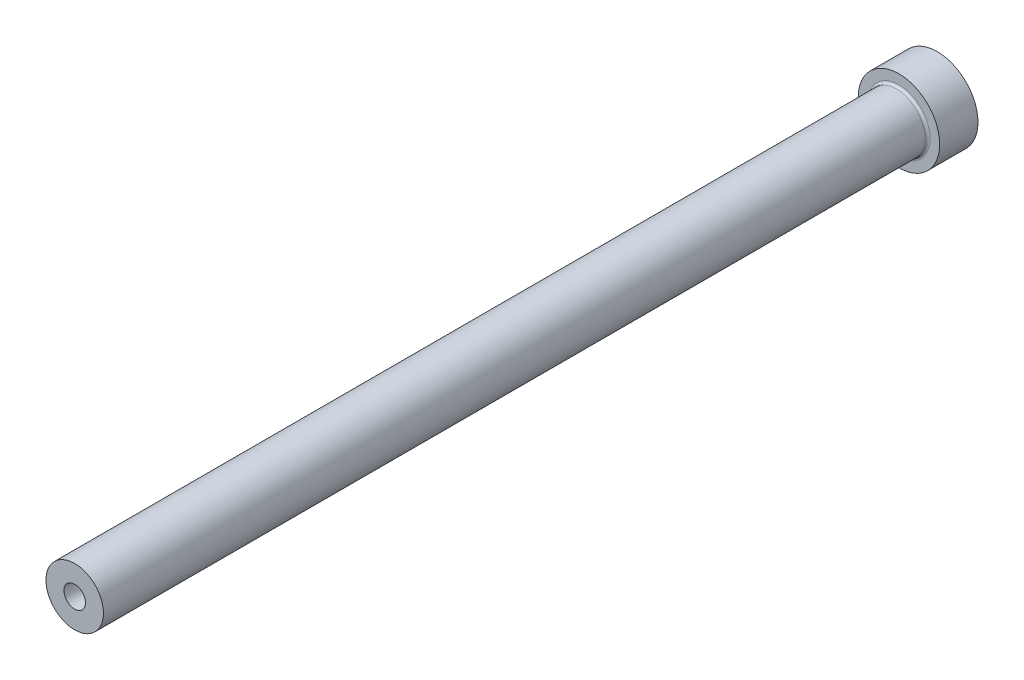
ISO-10303-21;
HEADER;
FILE_DESCRIPTION(('STEP AP214'),'2;1');
FILE_NAME('part.step','',(''),(''),'','','');
FILE_SCHEMA(('AUTOMOTIVE_DESIGN { 1 0 10303 214 1 1 1 1 }'));
ENDSEC;
DATA;
#1=APPLICATION_CONTEXT('core data for automotive mechanical design processes');
#2=APPLICATION_PROTOCOL_DEFINITION('international standard','automotive_design',2000,#1);
#3=PRODUCT_CONTEXT('',#1,'mechanical');
#4=PRODUCT('Part','Part','',(#3));
#5=PRODUCT_RELATED_PRODUCT_CATEGORY('part','',(#4));
#6=PRODUCT_DEFINITION_FORMATION('','',#4);
#7=PRODUCT_DEFINITION_CONTEXT('part definition',#1,'design');
#8=PRODUCT_DEFINITION('design','',#6,#7);
#9=PRODUCT_DEFINITION_SHAPE('','',#8);
#10=(LENGTH_UNIT() NAMED_UNIT(*) SI_UNIT(.MILLI.,.METRE.));
#11=(NAMED_UNIT(*) PLANE_ANGLE_UNIT() SI_UNIT($,.RADIAN.));
#12=(NAMED_UNIT(*) SI_UNIT($,.STERADIAN.) SOLID_ANGLE_UNIT());
#13=UNCERTAINTY_MEASURE_WITH_UNIT(LENGTH_MEASURE(1.E-05),#10,'distance_accuracy_value','');
#14=(GEOMETRIC_REPRESENTATION_CONTEXT(3) GLOBAL_UNCERTAINTY_ASSIGNED_CONTEXT((#13)) GLOBAL_UNIT_ASSIGNED_CONTEXT((#10,
#11,#12)) REPRESENTATION_CONTEXT('',''));
#15=CARTESIAN_POINT('',(0.,0.,0.));
#16=DIRECTION('',(0.,0.,1.));
#17=DIRECTION('',(1.,0.,0.));
#18=AXIS2_PLACEMENT_3D('',#15,#16,#17);
#19=CARTESIAN_POINT('',(0.,0.,180.));
#20=DIRECTION('',(0.,0.,-1.));
#21=DIRECTION('',(-1.,0.,0.));
#22=AXIS2_PLACEMENT_3D('',#19,#20,#21);
#23=PLANE('',#22);
#24=CARTESIAN_POINT('',(0.,0.,180.));
#25=DIRECTION('',(0.,0.,1.));
#26=DIRECTION('',(1.,0.,0.));
#27=AXIS2_PLACEMENT_3D('',#24,#25,#26);
#28=CIRCLE('',#27,2.24999999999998);
#29=CARTESIAN_POINT('',(2.24999999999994,0.,180.));
#30=VERTEX_POINT('',#29);
#31=EDGE_CURVE('E63',#30,#30,#28,.T.);
#32=ORIENTED_EDGE('',*,*,#31,.F.);
#33=EDGE_LOOP('',(#32));
#34=FACE_BOUND('',#33,.T.);
#35=CARTESIAN_POINT('',(0.,0.,180.));
#36=DIRECTION('',(0.,0.,1.));
#37=DIRECTION('',(1.,0.,0.));
#38=AXIS2_PLACEMENT_3D('',#35,#36,#37);
#39=CIRCLE('',#38,5.99999999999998);
#40=CARTESIAN_POINT('',(5.99999999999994,0.,180.));
#41=VERTEX_POINT('',#40);
#42=EDGE_CURVE('E54',#41,#41,#39,.T.);
#43=ORIENTED_EDGE('',*,*,#42,.T.);
#44=EDGE_LOOP('',(#43));
#45=FACE_BOUND('',#44,.T.);
#46=ADVANCED_FACE('F34',(#34,#45),#23,.F.);
#47=CARTESIAN_POINT('',(0.,0.,180.));
#48=DIRECTION('',(0.,0.,1.));
#49=DIRECTION('',(1.,0.,0.));
#50=AXIS2_PLACEMENT_3D('',#47,#48,#49);
#51=CYLINDRICAL_SURFACE('',#50,5.99999999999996);
#52=CARTESIAN_POINT('',(0.,0.,8.50000000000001));
#53=DIRECTION('',(0.,0.,1.));
#54=DIRECTION('',(1.,0.,0.));
#55=AXIS2_PLACEMENT_3D('',#52,#53,#54);
#56=CIRCLE('',#55,5.99999999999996);
#57=CARTESIAN_POINT('',(5.99999999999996,0.,8.50000000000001));
#58=VERTEX_POINT('',#57);
#59=EDGE_CURVE('E49',#58,#58,#56,.T.);
#60=ORIENTED_EDGE('',*,*,#59,.T.);
#61=EDGE_LOOP('',(#60));
#62=FACE_BOUND('',#61,.T.);
#63=ORIENTED_EDGE('',*,*,#42,.F.);
#64=EDGE_LOOP('',(#63));
#65=FACE_BOUND('',#64,.T.);
#66=ADVANCED_FACE('F92',(#62,#65),#51,.T.);
#67=CARTESIAN_POINT('',(0.,0.,7.99999999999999));
#68=DIRECTION('',(0.,0.,1.));
#69=DIRECTION('',(1.,0.,0.));
#70=AXIS2_PLACEMENT_3D('',#67,#68,#69);
#71=PLANE('',#70);
#72=CARTESIAN_POINT('',(0.,0.,7.99999999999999));
#73=DIRECTION('',(0.,0.,1.));
#74=DIRECTION('',(1.,0.,0.));
#75=AXIS2_PLACEMENT_3D('',#72,#73,#74);
#76=CIRCLE('',#75,6.49999999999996);
#77=CARTESIAN_POINT('',(6.49999999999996,0.,8.));
#78=VERTEX_POINT('',#77);
#79=EDGE_CURVE('E45',#78,#78,#76,.F.);
#80=ORIENTED_EDGE('',*,*,#79,.T.);
#81=EDGE_LOOP('',(#80));
#82=FACE_BOUND('',#81,.T.);
#83=CARTESIAN_POINT('',(0.,0.,8.00000000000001));
#84=DIRECTION('',(0.,0.,1.));
#85=DIRECTION('',(1.,0.,0.));
#86=AXIS2_PLACEMENT_3D('',#83,#84,#85);
#87=CIRCLE('',#86,8.49999999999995);
#88=CARTESIAN_POINT('',(8.49999999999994,0.,8.00000000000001));
#89=VERTEX_POINT('',#88);
#90=EDGE_CURVE('E57',#89,#89,#87,.T.);
#91=ORIENTED_EDGE('',*,*,#90,.T.);
#92=EDGE_LOOP('',(#91));
#93=FACE_BOUND('',#92,.T.);
#94=ADVANCED_FACE('F98',(#82,#93),#71,.T.);
#95=CARTESIAN_POINT('',(0.,0.,180.));
#96=DIRECTION('',(0.,0.,1.));
#97=DIRECTION('',(1.,0.,0.));
#98=AXIS2_PLACEMENT_3D('',#95,#96,#97);
#99=CYLINDRICAL_SURFACE('',#98,8.49999999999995);
#100=ORIENTED_EDGE('',*,*,#90,.F.);
#101=EDGE_LOOP('',(#100));
#102=FACE_BOUND('',#101,.T.);
#103=CARTESIAN_POINT('',(0.,0.,0.));
#104=DIRECTION('',(0.,0.,1.));
#105=DIRECTION('',(1.,0.,0.));
#106=AXIS2_PLACEMENT_3D('',#103,#104,#105);
#107=CIRCLE('',#106,8.49999999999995);
#108=CARTESIAN_POINT('',(8.49999999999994,0.,0.));
#109=VERTEX_POINT('',#108);
#110=EDGE_CURVE('E60',#109,#109,#107,.T.);
#111=ORIENTED_EDGE('',*,*,#110,.T.);
#112=EDGE_LOOP('',(#111));
#113=FACE_BOUND('',#112,.T.);
#114=ADVANCED_FACE('F89',(#102,#113),#99,.T.);
#115=CARTESIAN_POINT('',(0.,0.,0.));
#116=DIRECTION('',(0.,0.,1.));
#117=DIRECTION('',(1.,0.,0.));
#118=AXIS2_PLACEMENT_3D('',#115,#116,#117);
#119=PLANE('',#118);
#120=CARTESIAN_POINT('',(0.,0.,0.));
#121=DIRECTION('',(0.,0.,1.));
#122=DIRECTION('',(1.,0.,0.));
#123=AXIS2_PLACEMENT_3D('',#120,#121,#122);
#124=CIRCLE('',#123,2.99999999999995);
#125=CARTESIAN_POINT('',(2.99999999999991,0.,0.));
#126=VERTEX_POINT('',#125);
#127=EDGE_CURVE('E41',#126,#126,#124,.T.);
#128=ORIENTED_EDGE('',*,*,#127,.T.);
#129=EDGE_LOOP('',(#128));
#130=FACE_BOUND('',#129,.T.);
#131=ORIENTED_EDGE('',*,*,#110,.F.);
#132=EDGE_LOOP('',(#131));
#133=FACE_BOUND('',#132,.T.);
#134=ADVANCED_FACE('F83',(#130,#133),#119,.F.);
#135=CARTESIAN_POINT('',(0.,0.,180.));
#136=DIRECTION('',(0.,0.,1.));
#137=DIRECTION('',(1.,0.,0.));
#138=AXIS2_PLACEMENT_3D('',#135,#136,#137);
#139=CYLINDRICAL_SURFACE('',#138,2.24999999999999);
#140=ORIENTED_EDGE('',*,*,#31,.T.);
#141=EDGE_LOOP('',(#140));
#142=FACE_BOUND('',#141,.T.);
#143=CARTESIAN_POINT('',(0.,0.,105.));
#144=DIRECTION('',(0.,0.,1.));
#145=DIRECTION('',(1.,0.,0.));
#146=AXIS2_PLACEMENT_3D('',#143,#144,#145);
#147=CIRCLE('',#146,2.24999999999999);
#148=CARTESIAN_POINT('',(2.24999999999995,0.,105.));
#149=VERTEX_POINT('',#148);
#150=EDGE_CURVE('E66',#149,#149,#147,.T.);
#151=ORIENTED_EDGE('',*,*,#150,.F.);
#152=EDGE_LOOP('',(#151));
#153=FACE_BOUND('',#152,.T.);
#154=ADVANCED_FACE('F78',(#142,#153),#139,.F.);
#155=CARTESIAN_POINT('',(0.,0.,105.));
#156=DIRECTION('',(0.,0.,-1.));
#157=DIRECTION('',(-1.,0.,0.));
#158=AXIS2_PLACEMENT_3D('',#155,#156,#157);
#159=CONICAL_SURFACE('',#158,2.24999999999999,0.523598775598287);
#160=CARTESIAN_POINT('',(0.,0.,104.566987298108));
#161=DIRECTION('',(0.,0.,1.));
#162=DIRECTION('',(1.,0.,0.));
#163=AXIS2_PLACEMENT_3D('',#160,#161,#162);
#164=CIRCLE('',#163,2.49999999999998);
#165=CARTESIAN_POINT('',(2.49999999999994,0.,104.566987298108));
#166=VERTEX_POINT('',#165);
#167=EDGE_CURVE('E69',#166,#166,#164,.T.);
#168=ORIENTED_EDGE('',*,*,#167,.F.);
#169=EDGE_LOOP('',(#168));
#170=FACE_BOUND('',#169,.T.);
#171=ORIENTED_EDGE('',*,*,#150,.T.);
#172=EDGE_LOOP('',(#171));
#173=FACE_BOUND('',#172,.T.);
#174=ADVANCED_FACE('F75',(#170,#173),#159,.F.);
#175=CARTESIAN_POINT('',(0.,0.,180.));
#176=DIRECTION('',(0.,0.,1.));
#177=DIRECTION('',(1.,0.,0.));
#178=AXIS2_PLACEMENT_3D('',#175,#176,#177);
#179=CYLINDRICAL_SURFACE('',#178,2.49999999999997);
#180=CARTESIAN_POINT('',(0.,0.,0.5));
#181=DIRECTION('',(0.,0.,1.));
#182=DIRECTION('',(1.,0.,0.));
#183=AXIS2_PLACEMENT_3D('',#180,#181,#182);
#184=CIRCLE('',#183,2.49999999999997);
#185=CARTESIAN_POINT('',(2.49999999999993,0.,0.5));
#186=VERTEX_POINT('',#185);
#187=EDGE_CURVE('E10',#186,#186,#184,.F.);
#188=ORIENTED_EDGE('',*,*,#187,.T.);
#189=EDGE_LOOP('',(#188));
#190=FACE_BOUND('',#189,.T.);
#191=ORIENTED_EDGE('',*,*,#167,.T.);
#192=EDGE_LOOP('',(#191));
#193=FACE_BOUND('',#192,.T.);
#194=ADVANCED_FACE('F73',(#190,#193),#179,.F.);
#195=CARTESIAN_POINT('',(0.,0.,8.50000000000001));
#196=DIRECTION('',(0.,0.,1.));
#197=DIRECTION('',(1.,0.,0.));
#198=AXIS2_PLACEMENT_3D('',#195,#196,#197);
#199=TOROIDAL_SURFACE('',#198,6.49999999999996,0.5);
#200=ORIENTED_EDGE('',*,*,#79,.F.);
#201=EDGE_LOOP('',(#200));
#202=FACE_BOUND('',#201,.T.);
#203=ORIENTED_EDGE('',*,*,#59,.F.);
#204=EDGE_LOOP('',(#203));
#205=FACE_BOUND('',#204,.T.);
#206=ADVANCED_FACE('F104',(#202,#205),#199,.F.);
#207=CARTESIAN_POINT('',(0.,0.,0.));
#208=DIRECTION('',(0.,0.,-1.));
#209=DIRECTION('',(-1.,0.,0.));
#210=AXIS2_PLACEMENT_3D('',#207,#208,#209);
#211=CONICAL_SURFACE('',#210,2.99999999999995,0.785398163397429);
#212=ORIENTED_EDGE('',*,*,#187,.F.);
#213=EDGE_LOOP('',(#212));
#214=FACE_BOUND('',#213,.T.);
#215=ORIENTED_EDGE('',*,*,#127,.F.);
#216=EDGE_LOOP('',(#215));
#217=FACE_BOUND('',#216,.T.);
#218=ADVANCED_FACE('F36',(#214,#217),#211,.F.);
#219=CLOSED_SHELL('',(#46,#66,#94,#114,#134,#154,#174,#194,#206,#218));
#220=MANIFOLD_SOLID_BREP('B2',#219);
#221=ADVANCED_BREP_SHAPE_REPRESENTATION('',(#18,#220),#14);
#222=SHAPE_DEFINITION_REPRESENTATION(#9,#221);
ENDSEC;
END-ISO-10303-21;
